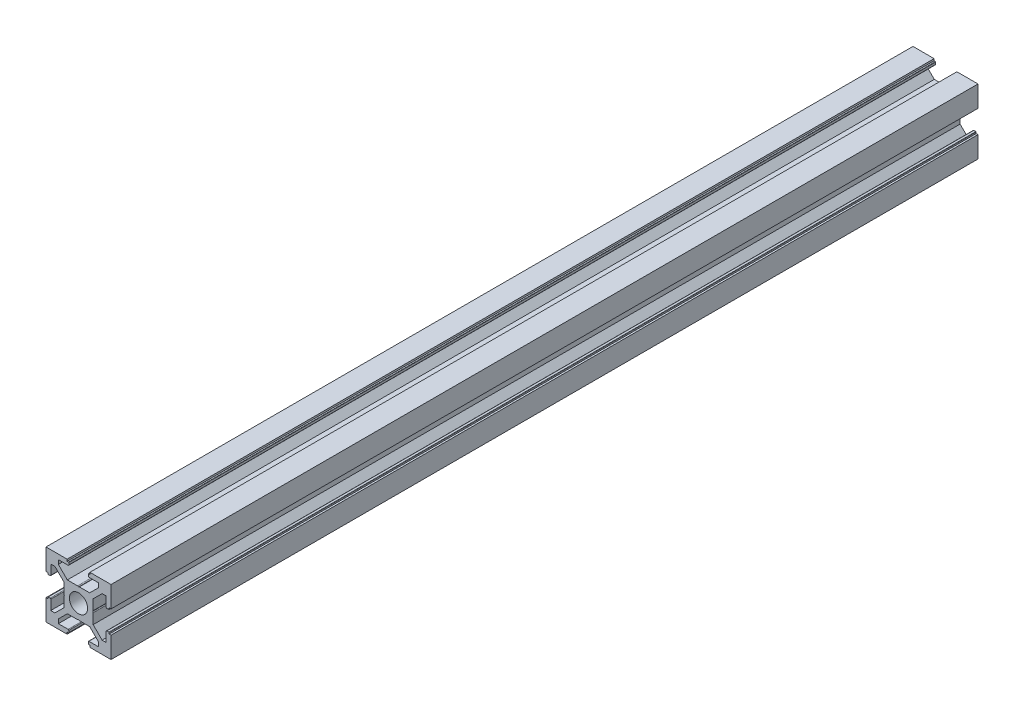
from build123d import *

# Parameters (mm, degrees)
CROQUIS1_R     = 4.2
EXTRUIR1_DEPTH = 400


with BuildPart() as part:
    # Croquis1 → Extruir1 (new body)
    with BuildSketch(Plane.XY):
        with BuildLine():
            Line((-5.25, 15), (-15, 15))
            Line((-15, 15), (-15, 5.25))
            Line((-15, 5.25), (-14.145, 5.25))
            Line((-14.145, 5.25), (-14.145, 4.65))
            ThreePointArc((-14.145, 4.65), (-14.101066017, 4.543933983), (-13.995, 4.5))
            Line((-13.995, 4.5), (-13.095, 4.5))
            ThreePointArc((-13.095, 4.5), (-12.882867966, 4.587867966), (-12.795, 4.8))
            Line((-12.795, 4.8), (-12.795, 9.3))
            Line((-12.795, 9.3), (-10.890990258, 9.3))
            Line((-10.890990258, 9.3), (-8.295495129, 6.704504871))
            Line((-8.295495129, 6.704504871), (-6.75, 5.159009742))
            Line((-6.75, 5.159009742), (-6.75, 0.45))
            ThreePointArc((-6.75, 0.45), (-6.618198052, 0.131801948), (-6.3, 0))
            ThreePointArc((-6.3, 0), (-6.618198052, -0.131801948), (-6.75, -0.45))
            Line((-6.75, -0.45), (-6.75, -5.159009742))
            Line((-6.75, -5.159009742), (-8.295495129, -6.704504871))
            Line((-8.295495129, -6.704504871), (-10.890990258, -9.3))
            Line((-10.890990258, -9.3), (-12.795, -9.3))
            Line((-12.795, -9.3), (-12.795, -4.8))
            ThreePointArc((-12.795, -4.8), (-12.882867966, -4.587867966), (-13.095, -4.5))
            Line((-13.095, -4.5), (-13.995, -4.5))
            ThreePointArc((-13.995, -4.5), (-14.101066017, -4.543933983), (-14.145, -4.65))
            Line((-14.145, -4.65), (-14.145, -5.25))
            Line((-14.145, -5.25), (-15, -5.25))
            Line((-15, -5.25), (-15, -15))
            Line((-15, -15), (-5.25, -15))
            Line((-5.25, -15), (-5.25, -14.145))
            Line((-5.25, -14.145), (-4.65, -14.145))
            ThreePointArc((-4.65, -14.145), (-4.543933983, -14.101066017), (-4.5, -13.995))
            Line((-4.5, -13.995), (-4.5, -13.095))
            ThreePointArc((-4.5, -13.095), (-4.587867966, -12.882867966), (-4.8, -12.795))
            Line((-4.8, -12.795), (-9.3, -12.795))
            Line((-9.3, -12.795), (-9.3, -10.890990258))
            Line((-9.3, -10.890990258), (-6.704504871, -8.295495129))
            Line((-6.704504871, -8.295495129), (-5.159009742, -6.75))
            Line((-5.159009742, -6.75), (-0.45, -6.75))
            ThreePointArc((-0.45, -6.75), (-0.131801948, -6.618198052), (0, -6.3))
            ThreePointArc((0, -6.3), (0.131801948, -6.618198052), (0.45, -6.75))
            Line((0.45, -6.75), (5.159009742, -6.75))
            Line((5.159009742, -6.75), (6.704504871, -8.295495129))
            Line((6.704504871, -8.295495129), (9.3, -10.890990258))
            Line((9.3, -10.890990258), (9.3, -12.795))
            Line((9.3, -12.795), (4.8, -12.795))
            ThreePointArc((4.8, -12.795), (4.587867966, -12.882867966), (4.5, -13.095))
            Line((4.5, -13.095), (4.5, -13.995))
            ThreePointArc((4.5, -13.995), (4.543933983, -14.101066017), (4.65, -14.145))
            Line((4.65, -14.145), (5.25, -14.145))
            Line((5.25, -14.145), (5.25, -15))
            Line((5.25, -15), (15, -15))
            Line((15, -15), (15, -5.25))
            Line((15, -5.25), (14.145, -5.25))
            Line((14.145, -5.25), (14.145, -4.65))
            ThreePointArc((14.145, -4.65), (14.101066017, -4.543933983), (13.995, -4.5))
            Line((13.995, -4.5), (13.095, -4.5))
            ThreePointArc((13.095, -4.5), (12.882867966, -4.587867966), (12.795, -4.8))
            Line((12.795, -4.8), (12.795, -9.3))
            Line((12.795, -9.3), (10.890990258, -9.3))
            Line((10.890990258, -9.3), (8.295495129, -6.704504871))
            Line((8.295495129, -6.704504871), (6.75, -5.159009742))
            Line((6.75, -5.159009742), (6.75, -0.45))
            ThreePointArc((6.75, -0.45), (6.618198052, -0.131801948), (6.3, 0))
            ThreePointArc((6.3, 0), (6.618198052, 0.131801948), (6.75, 0.45))
            Line((6.75, 0.45), (6.75, 5.159009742))
            Line((6.75, 5.159009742), (8.295495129, 6.704504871))
            Line((8.295495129, 6.704504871), (10.890990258, 9.3))
            Line((10.890990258, 9.3), (12.795, 9.3))
            Line((12.795, 9.3), (12.795, 4.8))
            ThreePointArc((12.795, 4.8), (12.882867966, 4.587867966), (13.095, 4.5))
            Line((13.095, 4.5), (13.995, 4.5))
            ThreePointArc((13.995, 4.5), (14.101066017, 4.543933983), (14.145, 4.65))
            Line((14.145, 4.65), (14.145, 5.25))
            Line((14.145, 5.25), (15, 5.25))
            Line((15, 5.25), (15, 15))
            Line((15, 15), (5.25, 15))
            Line((5.25, 15), (5.25, 14.145))
            Line((5.25, 14.145), (4.65, 14.145))
            ThreePointArc((4.65, 14.145), (4.543933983, 14.101066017), (4.5, 13.995))
            Line((4.5, 13.995), (4.5, 13.095))
            ThreePointArc((4.5, 13.095), (4.587867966, 12.882867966), (4.8, 12.795))
            Line((4.8, 12.795), (9.3, 12.795))
            Line((9.3, 12.795), (9.3, 10.890990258))
            Line((9.3, 10.890990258), (6.704504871, 8.295495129))
            Line((6.704504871, 8.295495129), (5.159009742, 6.75))
            Line((5.159009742, 6.75), (0.45, 6.75))
            ThreePointArc((0.45, 6.75), (0.131801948, 6.618198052), (0, 6.3))
            ThreePointArc((0, 6.3), (-0.131801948, 6.618198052), (-0.45, 6.75))
            Line((-0.45, 6.75), (-5.159009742, 6.75))
            Line((-5.159009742, 6.75), (-6.704504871, 8.295495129))
            Line((-6.704504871, 8.295495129), (-9.3, 10.890990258))
            Line((-9.3, 10.890990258), (-9.3, 12.795))
            Line((-9.3, 12.795), (-4.8, 12.795))
            ThreePointArc((-4.8, 12.795), (-4.587867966, 12.882867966), (-4.5, 13.095))
            Line((-4.5, 13.095), (-4.5, 13.995))
            ThreePointArc((-4.5, 13.995), (-4.543933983, 14.101066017), (-4.65, 14.145))
            Line((-4.65, 14.145), (-5.25, 14.145))
            Line((-5.25, 14.145), (-5.25, 15))
        make_face()
        Circle(CROQUIS1_R, mode=Mode.SUBTRACT)
    extrude(amount=EXTRUIR1_DEPTH)


solid = part.part
